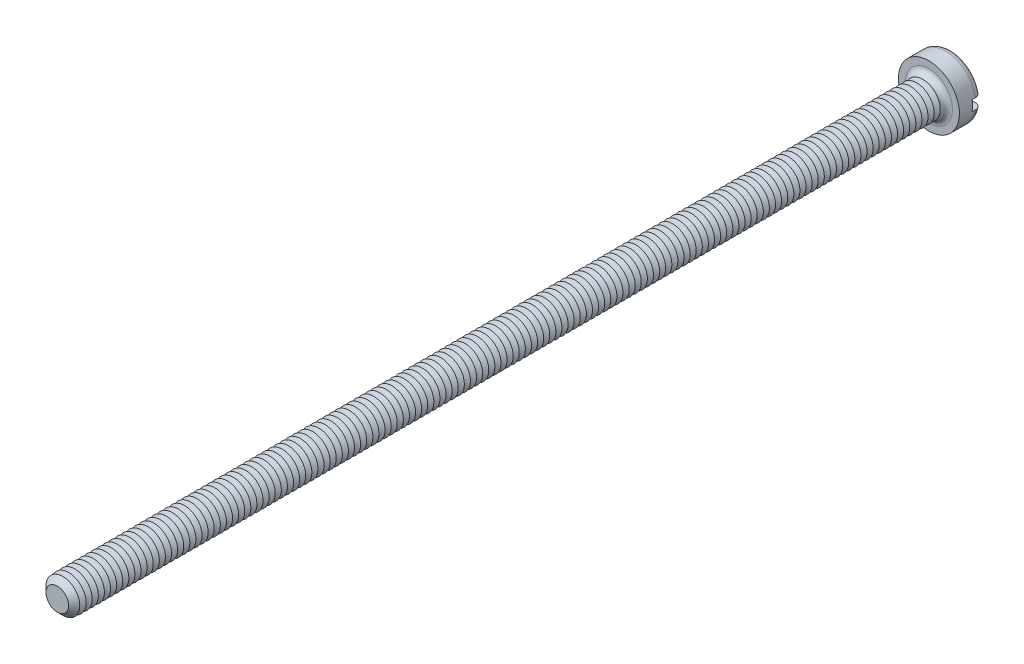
from build123d import *

# Parameters (mm, degrees)
SKETCH3_R           = 3.5
BOSS_EXTRUDE2_DEPTH = 2.6
SKETCH4_R           = 2
BOSS_EXTRUDE3_DEPTH = 100
FILLET1_R           = 0.7
CHAMFER1_SIZE       = 0.7
LPATTERN1_COUNT     = 141
LPATTERN1_PITCH     = 0.7
SKETCH8_W           = 7
SKETCH8_H           = 1.2
CUT_EXTRUDE1_DEPTH  = 1.1


with BuildPart() as part:
    # Sketch3 → Boss-Extrude2 (new body)
    with BuildSketch(Plane.XY):
        Circle(SKETCH3_R)
    extrude(amount=-BOSS_EXTRUDE2_DEPTH)

    # Sketch4 → Boss-Extrude3 (add)
    with BuildSketch(Plane.XY):
        Circle(SKETCH4_R)
    extrude(amount=BOSS_EXTRUDE3_DEPTH)

    # Fillet1
    fillet1_edges = [part.edges().sort_by_distance(p)[0] for p in [
        (-3.5, 0, -2.6),
        (-2, 0, 0),
    ]]
    fillet(fillet1_edges, radius=FILLET1_R)

    # Chamfer1
    chamfer1_edges = [part.edges().sort_by_distance(p)[0] for p in [
        (-2, 0, 100),
    ]]
    chamfer(chamfer1_edges, length=CHAMFER1_SIZE)

    # Sketch6 → Cut-Revolve1 (revolve, cut)
    with BuildSketch(Plane(origin=(0, 0, 0), x_dir=(0, 0, -1), z_dir=(1, 0, 0)), mode=Mode.PRIVATE) as cut_revolve1_sk:
        Polygon((-0.7, 2), (-1.05, 1.393782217), (-1.4, 2), align=None)
    cut_revolve1 = revolve(cut_revolve1_sk.sketch.rotate(Axis((0, 0, -1.694361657), (0, 0, 1)), 90), axis=Axis((0, 0, -1.694361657), (0, 0, 1)), mode=Mode.SUBTRACT)

    # LPattern1: Cut-Revolve1 ×141
    with Locations(*[(0, 0, i * LPATTERN1_PITCH) for i in range(1, LPATTERN1_COUNT)]):
        add(cut_revolve1, mode=Mode.SUBTRACT)

    # Sketch8 → Cut-Extrude1 (cut)
    with BuildSketch(Plane(origin=(0, 0, -2.6), x_dir=(-1, 0, 0), z_dir=(0, 0, -1))):
        Rectangle(SKETCH8_W, SKETCH8_H)
    extrude(amount=-CUT_EXTRUDE1_DEPTH, mode=Mode.SUBTRACT)


solid = part.part
